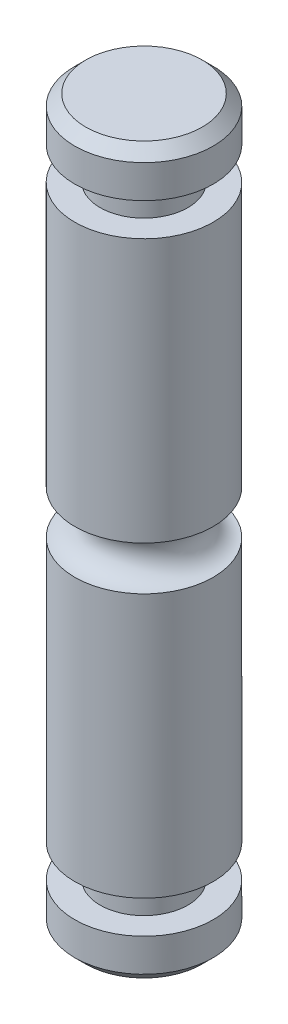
from build123d import *

# Parameters (mm, degrees)
BOSS_EXTRU_1_DEPTH      = 16.5
BOSS_EXTRU_1_DEPTH_BACK = 16.5
ESQUISSE1_R             = 3.15
ESQUISSE3_R             = 1
ESQUISSE3_W             = 2
ESQUISSE3_H             = 1.5
CHANFREIN1_SIZE         = 0.5


with BuildPart() as part:
    # Esquisse1 → Boss.-Extru.1 (new, two sides: drawn at the far end of the back side and taken through both)
    with BuildSketch(Plane(origin=(0, 0, 0), x_dir=(1, 0, 0), z_dir=(0, 1, 0)).offset(-BOSS_EXTRU_1_DEPTH_BACK)):
        with Locations(Location((0, 0, 0), (0, 0, 270))):
            Circle(ESQUISSE1_R)
    extrude(amount=BOSS_EXTRU_1_DEPTH + BOSS_EXTRU_1_DEPTH_BACK)

    # Esquisse3 → Enl_vement de mati_re-R_volution1 (revolve, cut)
    with BuildSketch(Plane(origin=(0, 0, 0), x_dir=(0, 0, -1), z_dir=(1, 0, 0))):
        with Locations((3.15, 0)):
            Circle(ESQUISSE3_R)
        with Locations((3, -13.75)):
            Rectangle(ESQUISSE3_W, ESQUISSE3_H)
        with Locations((3, 13.75)):
            Rectangle(ESQUISSE3_W, ESQUISSE3_H)
    revolve(axis=Axis((0, 0, 0), (0, 1, 0)), mode=Mode.SUBTRACT)

    # Chanfrein1
    chanfrein1_edges = [part.edges().sort_by_distance(p)[0] for p in [
        (0, -16.5, -3.15),
        (0, 16.5, -3.15),
    ]]
    chamfer(chanfrein1_edges, length=CHANFREIN1_SIZE)


solid = part.part
